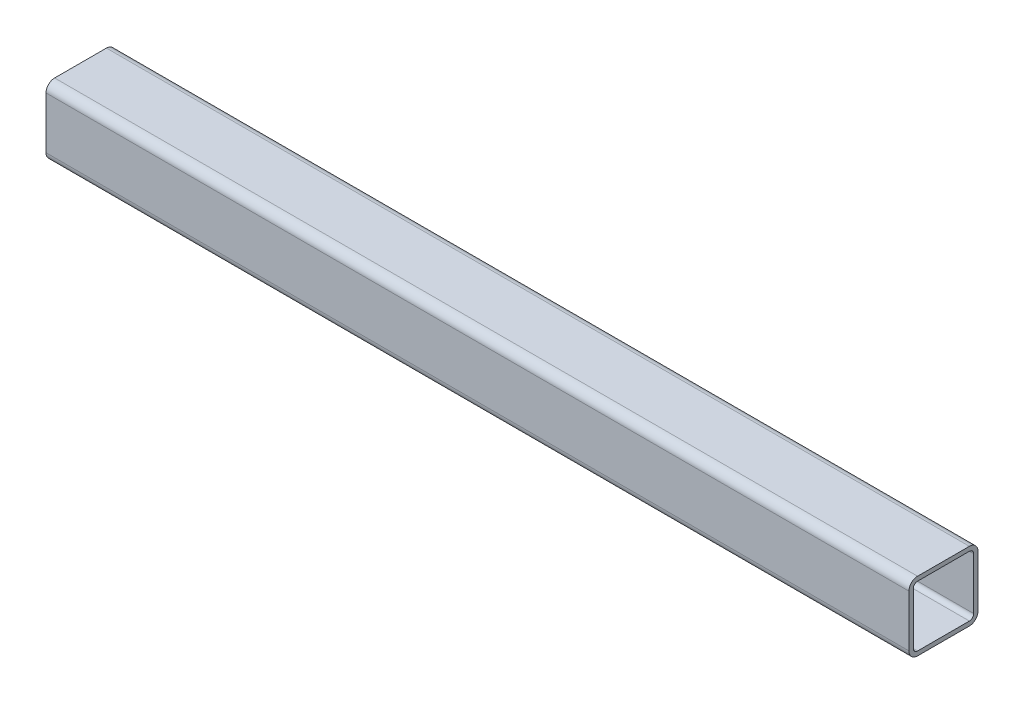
from build123d import *

# Parameters (mm, degrees)
STRUCTURAL_MEMBER1_DEPTH = 1270


with BuildPart() as part:
    # Sketch11 → Structural Member1 (new body)
    with BuildSketch(Plane.YZ.offset(-635)):
        with BuildLine():
            Line((-38.1, -50.8), (38.1, -50.8))
            ThreePointArc((38.1, -50.8), (47.080256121, -47.080256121), (50.8, -38.1))
            Line((50.8, -38.1), (50.8, 38.1))
            ThreePointArc((50.8, 38.1), (47.080256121, 47.080256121), (38.1, 50.8))
            Line((38.1, 50.8), (-38.1, 50.8))
            ThreePointArc((-38.1, 50.8), (-47.080256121, 47.080256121), (-50.8, 38.1))
            Line((-50.8, 38.1), (-50.8, -38.1))
            ThreePointArc((-50.8, -38.1), (-47.080256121, -47.080256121), (-38.1, -50.8))
        make_face()
        with BuildLine():
            Line((-38.1, -44.45), (38.1, -44.45))
            ThreePointArc((38.1, -44.45), (42.590128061, -42.590128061), (44.45, -38.1))
            Line((44.45, -38.1), (44.45, 38.1))
            ThreePointArc((44.45, 38.1), (42.590128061, 42.590128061), (38.1, 44.45))
            Line((38.1, 44.45), (-38.1, 44.45))
            ThreePointArc((-38.1, 44.45), (-42.590128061, 42.590128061), (-44.45, 38.1))
            Line((-44.45, 38.1), (-44.45, -38.1))
            ThreePointArc((-44.45, -38.1), (-42.590128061, -42.590128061), (-38.1, -44.45))
        make_face(mode=Mode.SUBTRACT)
    extrude(amount=STRUCTURAL_MEMBER1_DEPTH)


solid = part.part
